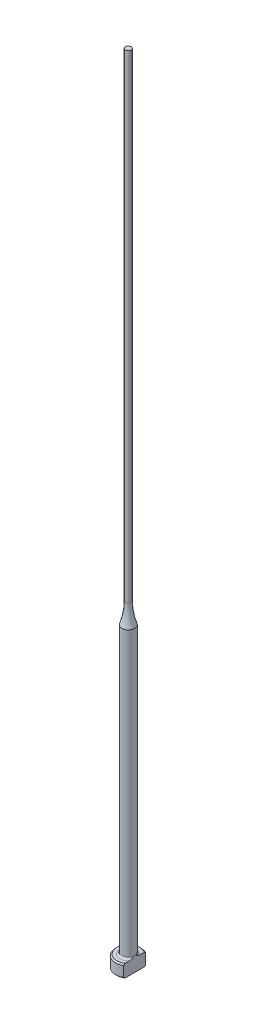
from build123d import *
from build123d.topology import SkipClean

# Parameters (mm, degrees)
CHAMFER1_SIZE = 0.2
FILLET1_R     = 0.3
KEY_DEPTH     = 126.031995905


with BuildPart() as part:
    # Sketch1 → Revolve1 (revolve)
    with BuildSketch(Plane.XY, mode=Mode.PRIVATE) as revolve1_sk:
        with BuildLine():
            Line((0, 0), (-2, 0))
            Line((-2, 0), (-2, 2))
            Line((-2, 2), (-1, 2))
            Line((-1, 2), (-1, 46.729296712))
            ThreePointArc((-1, 46.729296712), (-0.588458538, 48.341687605), (-0.45, 50))
            Line((-0.45, 50), (-0.45, 125))
            Line((-0.45, 125), (0, 125))
            Line((0, 125), (0, 0))
        make_face()
    revolve(revolve1_sk.sketch.rotate(Axis((0, 259.958771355, 0), (0, -1, 0)), 270), axis=Axis((0, 259.958771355, 0), (0, -1, 0)))

    # Chamfer1
    chamfer1_edges = [part.edges().sort_by_distance(p)[0] for p in [
        (0, 0, -2),
        (0, 2, -2),
    ]]
    chamfer(chamfer1_edges, length=CHAMFER1_SIZE)

    # Fillet1
    fillet1_edges = [part.edges().sort_by_distance(p)[0] for p in [
        (0, 2, -1),
    ]]
    fillet(fillet1_edges, radius=FILLET1_R)

    # Sketch2 → KEY (cut, through all)
    with SkipClean():  # the faces are left unmerged after this step: merging them gives an invalid solid
        with BuildSketch(Plane(origin=(0, 0, 0), x_dir=(1, 0, 0), z_dir=(0, 1, 0))):
            with BuildLine():
                Line((1, 1.732050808), (1, -1.732050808))
                ThreePointArc((1, -1.732050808), (2, 0), (1, 1.732050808))
            make_face()
        extrude(amount=KEY_DEPTH, mode=Mode.SUBTRACT)


solid = part.part
